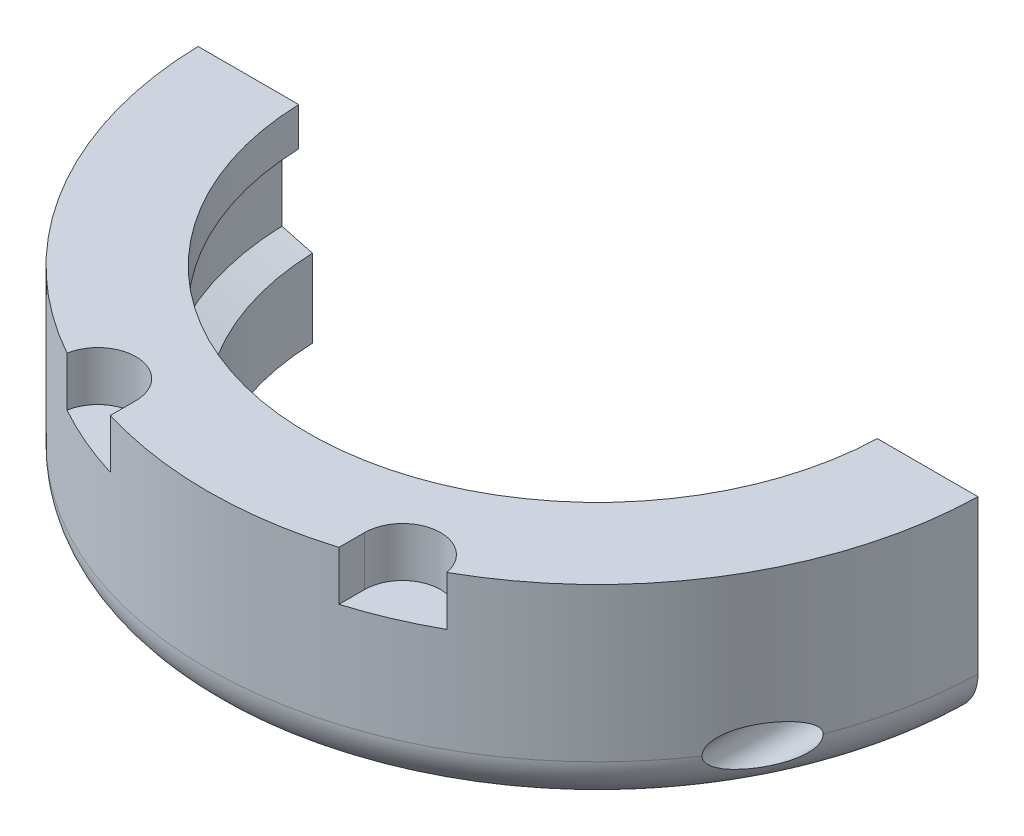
from build123d import *

# Parameters (mm, degrees)
SKETCH2_R              = 1.7272
CUT_EXTRUDE2_DEPTH     = 55.458192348
SKETCH4_W              = 88.9
SKETCH4_H              = 38.1
CUT_EXTRUDE_3256_DEPTH = 49.904967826
SKETCH3_R              = 3.429
CUT_EXTRUDE3_DEPTH     = 55.452314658
CUT_EXTRUDE9_DEPTH     = 4.1148


with BuildPart() as part:
    # Sketch1 → Base-Revolve (revolve)
    with BuildSketch(Plane.XY):
        with BuildLine():
            Line((22.987, 0), (28.6512, 0))
            ThreePointArc((28.6512, 0), (31.381197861, 1.130802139), (32.512, 3.8608))
            Line((32.512, 3.8608), (32.512, 16.6624))
            Line((32.512, 16.6624), (24.13, 16.6624))
            Line((24.13, 16.6624), (24.13, 13.456790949))
            Line((24.13, 13.456790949), (25.527, 13.456790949))
            Line((25.527, 13.456790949), (25.527, 7.182990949))
            Line((25.527, 7.182990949), (22.987, 6.5024))
            Line((22.987, 6.5024), (22.987, 0))
        make_face()
    revolve(axis=Axis((0, 0, 0), (0, 1, 0)))

    # Sketch2 → Cut-Extrude2 (cut, through all)
    with BuildSketch(Plane.XY.offset(-7.874)):
        with Locations((-28.6512, 3.8608)):
            Circle(SKETCH2_R)
        with Locations((28.6512, 3.8608)):
            Circle(SKETCH2_R)
    extrude(amount=CUT_EXTRUDE2_DEPTH, mode=Mode.SUBTRACT)

    # Sketch4 → Cut-Extrude-3256 (cut, through all)
    with BuildSketch(Plane(origin=(0, 16.6624, 0), x_dir=(1, 0, 0), z_dir=(0, 1, 0))):
        with Locations((0, 18.2499)):
            Rectangle(SKETCH4_W, SKETCH4_H)
    extrude(amount=-CUT_EXTRUDE_3256_DEPTH, mode=Mode.SUBTRACT)

    # Sketch3 → Cut-Extrude3 (cut, through all)
    with BuildSketch(Plane.XY.offset(-7.874)):
        with Locations((28.6512, 3.8608)):
            Circle(SKETCH3_R)
        with Locations((-28.6512, 3.8608)):
            Circle(SKETCH3_R)
    extrude(amount=-CUT_EXTRUDE3_DEPTH, mode=Mode.SUBTRACT)

    # Sketch5 → Cut-Extrude9 (cut)
    with BuildSketch(Plane(origin=(0, 16.6624, 0), x_dir=(-1, 0, 0), z_dir=(0, 1, 0))):
        with BuildLine():
            Line((-9.525, 33.19499047), (-15.875, 31.519284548))
            Line((-15.875, 31.519284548), (-15.875, 28.956))
            ThreePointArc((-15.875, 28.956), (-12.7, 25.781), (-9.525, 28.956))
            Line((-9.525, 28.956), (-9.525, 33.19499047))
        make_face()
        with BuildLine():
            Line((9.525, 28.956), (9.525, 33.19499047))
            Line((9.525, 33.19499047), (15.875, 31.519284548))
            Line((15.875, 31.519284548), (15.875, 28.956))
            ThreePointArc((15.875, 28.956), (12.7, 25.781), (9.525, 28.956))
        make_face()
        with BuildLine():
            Line((-9.525, -28.956), (-9.525, -33.19499047))
            Line((-9.525, -33.19499047), (-15.875, -31.519284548))
            Line((-15.875, -31.519284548), (-15.875, -28.956))
            ThreePointArc((-15.875, -28.956), (-12.7, -25.781), (-9.525, -28.956))
        make_face()
        with BuildLine():
            Line((9.525, -33.19499047), (15.875, -31.519284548))
            Line((15.875, -31.519284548), (15.875, -28.956))
            ThreePointArc((15.875, -28.956), (12.7, -25.781), (9.525, -28.956))
            Line((9.525, -28.956), (9.525, -33.19499047))
        make_face()
    extrude(amount=-CUT_EXTRUDE9_DEPTH, mode=Mode.SUBTRACT)


solid = part.part
